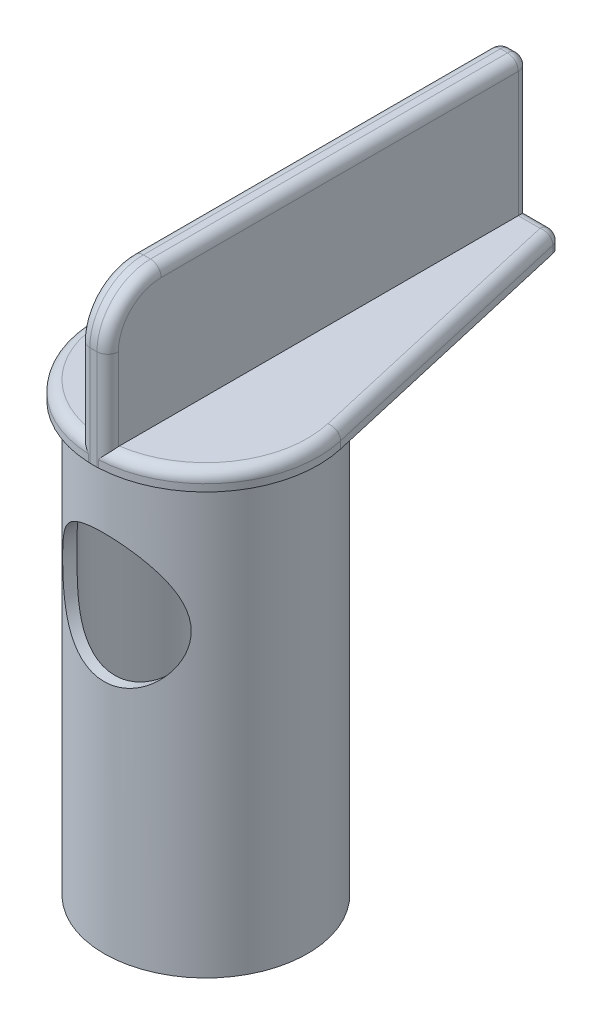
from build123d import *

# Parameters (mm, degrees)
SKIZZE1_R                       = 28.5
SKIZZE1_R_2                     = 25.5
LINEAR_AUSTRAGEN1_DEPTH         = 120
LINEAR_AUSTRAGEN2_DEPTH         = 5
VERRUNDUNG3_R                   = 3
LINEAR_AUSTRAGEN3_DEPTH         = 4
LINEAR_AUSTRAGEN3_DEPTH_BACK    = 4
VERRUNDUNG1_R                   = 3
SKIZZE4_R                       = 18
SCHNITT_LINEAR_AUSTRAGEN1_DEPTH = 74


with BuildPart() as part:
    # Skizze1 → Linear austragen1 (new body)
    with BuildSketch(Plane(origin=(0, 0, 0), x_dir=(1, 0, 0), z_dir=(0, 1, 0))):
        with Locations(Location((0, 0, 0), (0, 0, 270))):
            Circle(SKIZZE1_R)
        with Locations(Location((0, 0, 0), (0, 0, 270))):
            Circle(SKIZZE1_R_2, mode=Mode.SUBTRACT)
    extrude(amount=-LINEAR_AUSTRAGEN1_DEPTH)

    # Skizze2 → Linear austragen2 (add)
    with BuildSketch(Plane(origin=(0, 0, 0), x_dir=(1, 0, 0), z_dir=(0, 1, 0))):
        with BuildLine():
            Line((-10.10954569, 86.5), (10.10954569, 86.5))
            ThreePointArc((10.10954569, 86.5), (11.979075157, 85.846243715), (13.033793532, 84.169906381))
            Line((13.033793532, 84.169906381), (30.704602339, 7.034017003))
            ThreePointArc((30.704602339, 7.034017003), (0, -31.5), (-30.704602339, 7.034017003))
            Line((-30.704602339, 7.034017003), (-13.033793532, 84.169906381))
            ThreePointArc((-13.033793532, 84.169906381), (-11.979075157, 85.846243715), (-10.10954569, 86.5))
        make_face()
    extrude(amount=LINEAR_AUSTRAGEN2_DEPTH)

    # Verrundung3
    verrundung3_edges = [part.edges().sort_by_distance(p)[0] for p in [
        (-11.979075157, 5, -85.846243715),
        (-21.869197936, 5, -45.601961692),
        (0, 5, 31.5),
        (21.869197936, 5, -45.601961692),
        (11.979075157, 5, -85.846243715),
        (0, 5, -86.5),
    ]]
    fillet(verrundung3_edges, radius=VERRUNDUNG3_R)

    # Skizze3 → Linear austragen3 (add, two sides: drawn at the far end of the back side and taken through both)
    with BuildSketch(Plane(origin=(0, 0, 0), x_dir=(0, 0, -1), z_dir=(1, 0, 0)).offset(-LINEAR_AUSTRAGEN3_DEPTH_BACK)):
        with BuildLine():
            Line((86.5, 0), (-31.5, 0))
            Line((-31.5, 0), (-31.5, 28))
            ThreePointArc((-31.5, 28), (-27.106601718, 38.606601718), (-16.5, 43))
            Line((-16.5, 43), (83.5, 43))
            ThreePointArc((83.5, 43), (85.621320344, 42.121320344), (86.5, 40))
            Line((86.5, 40), (86.5, 0))
        make_face()
    extrude(amount=LINEAR_AUSTRAGEN3_DEPTH + LINEAR_AUSTRAGEN3_DEPTH_BACK)

    # Verrundung1
    verrundung1_edges = [part.edges().sort_by_distance(p)[0] for p in [
        (4, 21, -86.5),
        (4, 42.121320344, -85.621320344),
        (4, 43, -33.5),
        (4, 38.606601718, 27.106601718),
        (-4, 21, -86.5),
        (-4, 42.121320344, -85.621320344),
        (-4, 43, -33.5),
        (-4, 38.606601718, 27.106601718),
        (4, 14, 31.5),
        (-4, 14, 31.5),
    ]]
    fillet(verrundung1_edges, radius=VERRUNDUNG1_R)

    # Skizze4 → Schnitt-Linear austragen1 (cut)
    with BuildSketch(Plane.XY):
        with Locations(Location((0, -36, 0), (0, 0, 270))):
            Circle(SKIZZE4_R)
    extrude(amount=SCHNITT_LINEAR_AUSTRAGEN1_DEPTH, mode=Mode.SUBTRACT)


solid = part.part
